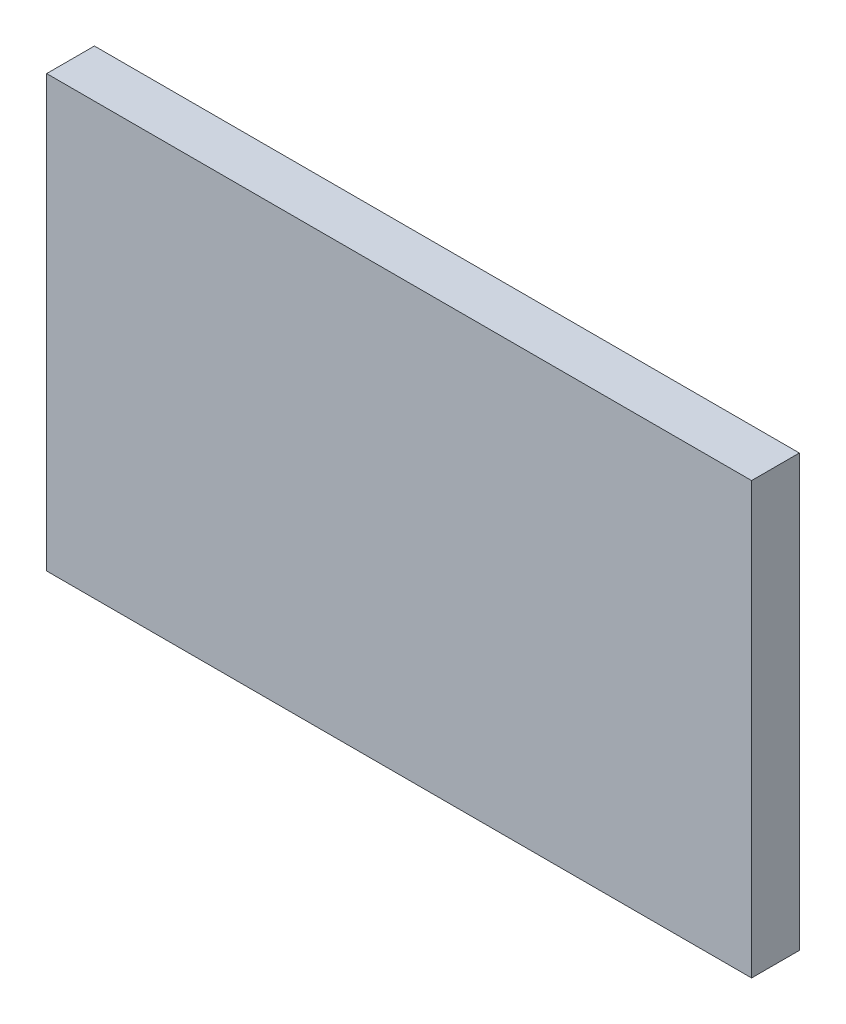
ISO-10303-21;
HEADER;
FILE_DESCRIPTION(('STEP AP214'),'2;1');
FILE_NAME('part.step','',(''),(''),'','','');
FILE_SCHEMA(('AUTOMOTIVE_DESIGN { 1 0 10303 214 1 1 1 1 }'));
ENDSEC;
DATA;
#1=APPLICATION_CONTEXT('core data for automotive mechanical design processes');
#2=APPLICATION_PROTOCOL_DEFINITION('international standard','automotive_design',2000,#1);
#3=PRODUCT_CONTEXT('',#1,'mechanical');
#4=PRODUCT('Part','Part','',(#3));
#5=PRODUCT_RELATED_PRODUCT_CATEGORY('part','',(#4));
#6=PRODUCT_DEFINITION_FORMATION('','',#4);
#7=PRODUCT_DEFINITION_CONTEXT('part definition',#1,'design');
#8=PRODUCT_DEFINITION('design','',#6,#7);
#9=PRODUCT_DEFINITION_SHAPE('','',#8);
#10=(LENGTH_UNIT() NAMED_UNIT(*) SI_UNIT(.MILLI.,.METRE.));
#11=(NAMED_UNIT(*) PLANE_ANGLE_UNIT() SI_UNIT($,.RADIAN.));
#12=(NAMED_UNIT(*) SI_UNIT($,.STERADIAN.) SOLID_ANGLE_UNIT());
#13=UNCERTAINTY_MEASURE_WITH_UNIT(LENGTH_MEASURE(1.E-05),#10,'distance_accuracy_value','');
#14=(GEOMETRIC_REPRESENTATION_CONTEXT(3) GLOBAL_UNCERTAINTY_ASSIGNED_CONTEXT((#13)) GLOBAL_UNIT_ASSIGNED_CONTEXT((#10,
#11,#12)) REPRESENTATION_CONTEXT('',''));
#15=CARTESIAN_POINT('',(0.,0.,0.));
#16=DIRECTION('',(0.,0.,1.));
#17=DIRECTION('',(1.,0.,0.));
#18=AXIS2_PLACEMENT_3D('',#15,#16,#17);
#19=CARTESIAN_POINT('',(8.675,23.1,-0.03048));
#20=DIRECTION('',(0.,-1.,0.));
#21=DIRECTION('',(0.,0.,-1.));
#22=AXIS2_PLACEMENT_3D('',#19,#20,#21);
#23=PLANE('',#22);
#24=DIRECTION('',(1.,0.,0.));
#25=VECTOR('',#24,1.);
#26=CARTESIAN_POINT('',(8.9,23.1,0.));
#27=LINE('',#26,#25);
#28=CARTESIAN_POINT('',(8.675,23.1,0.));
#29=VERTEX_POINT('',#28);
#30=CARTESIAN_POINT('',(9.125,23.1,0.));
#31=VERTEX_POINT('',#30);
#32=EDGE_CURVE('E75',#29,#31,#27,.T.);
#33=ORIENTED_EDGE('',*,*,#32,.T.);
#34=DIRECTION('',(0.,0.,-1.));
#35=VECTOR('',#34,1.);
#36=CARTESIAN_POINT('',(9.125,23.1,-0.01524));
#37=LINE('',#36,#35);
#38=CARTESIAN_POINT('',(9.125,23.1,-0.03048));
#39=VERTEX_POINT('',#38);
#40=EDGE_CURVE('E20',#31,#39,#37,.T.);
#41=ORIENTED_EDGE('',*,*,#40,.T.);
#42=DIRECTION('',(1.,0.,0.));
#43=VECTOR('',#42,1.);
#44=CARTESIAN_POINT('',(8.675,23.1,-0.03048));
#45=LINE('',#44,#43);
#46=CARTESIAN_POINT('',(8.675,23.1,-0.03048));
#47=VERTEX_POINT('',#46);
#48=EDGE_CURVE('E77',#47,#39,#45,.T.);
#49=ORIENTED_EDGE('',*,*,#48,.F.);
#50=DIRECTION('',(0.,0.,-1.));
#51=VECTOR('',#50,1.);
#52=CARTESIAN_POINT('',(8.675,23.1,-0.01524));
#53=LINE('',#52,#51);
#54=EDGE_CURVE('E11',#29,#47,#53,.T.);
#55=ORIENTED_EDGE('',*,*,#54,.F.);
#56=EDGE_LOOP('',(#33,#41,#49,#55));
#57=FACE_BOUND('',#56,.T.);
#58=ADVANCED_FACE('F17',(#57),#23,.F.);
#59=CARTESIAN_POINT('',(8.675,22.825,-0.03048));
#60=DIRECTION('',(1.,0.,0.));
#61=DIRECTION('',(0.,1.,0.));
#62=AXIS2_PLACEMENT_3D('',#59,#60,#61);
#63=PLANE('',#62);
#64=DIRECTION('',(0.,1.,0.));
#65=VECTOR('',#64,1.);
#66=CARTESIAN_POINT('',(8.675,22.9625,0.));
#67=LINE('',#66,#65);
#68=CARTESIAN_POINT('',(8.675,22.825,0.));
#69=VERTEX_POINT('',#68);
#70=EDGE_CURVE('E79',#69,#29,#67,.T.);
#71=ORIENTED_EDGE('',*,*,#70,.T.);
#72=ORIENTED_EDGE('',*,*,#54,.T.);
#73=DIRECTION('',(0.,1.,0.));
#74=VECTOR('',#73,1.);
#75=CARTESIAN_POINT('',(8.675,22.825,-0.03048));
#76=LINE('',#75,#74);
#77=CARTESIAN_POINT('',(8.675,22.825,-0.03048));
#78=VERTEX_POINT('',#77);
#79=EDGE_CURVE('E103',#78,#47,#76,.T.);
#80=ORIENTED_EDGE('',*,*,#79,.F.);
#81=DIRECTION('',(0.,0.,-1.));
#82=VECTOR('',#81,1.);
#83=CARTESIAN_POINT('',(8.675,22.825,-0.01524));
#84=LINE('',#83,#82);
#85=EDGE_CURVE('E27',#69,#78,#84,.T.);
#86=ORIENTED_EDGE('',*,*,#85,.F.);
#87=EDGE_LOOP('',(#71,#72,#80,#86));
#88=FACE_BOUND('',#87,.T.);
#89=ADVANCED_FACE('F80',(#88),#63,.F.);
#90=CARTESIAN_POINT('',(9.125,22.825,-0.03048));
#91=DIRECTION('',(0.,1.,0.));
#92=DIRECTION('',(1.,0.,0.));
#93=AXIS2_PLACEMENT_3D('',#90,#91,#92);
#94=PLANE('',#93);
#95=DIRECTION('',(-1.,0.,0.));
#96=VECTOR('',#95,1.);
#97=CARTESIAN_POINT('',(8.9,22.825,0.));
#98=LINE('',#97,#96);
#99=CARTESIAN_POINT('',(9.125,22.825,0.));
#100=VERTEX_POINT('',#99);
#101=EDGE_CURVE('E84',#100,#69,#98,.T.);
#102=ORIENTED_EDGE('',*,*,#101,.T.);
#103=ORIENTED_EDGE('',*,*,#85,.T.);
#104=DIRECTION('',(-1.,0.,0.));
#105=VECTOR('',#104,1.);
#106=CARTESIAN_POINT('',(9.125,22.825,-0.03048));
#107=LINE('',#106,#105);
#108=CARTESIAN_POINT('',(9.125,22.825,-0.03048));
#109=VERTEX_POINT('',#108);
#110=EDGE_CURVE('E99',#109,#78,#107,.T.);
#111=ORIENTED_EDGE('',*,*,#110,.F.);
#112=DIRECTION('',(0.,0.,-1.));
#113=VECTOR('',#112,1.);
#114=CARTESIAN_POINT('',(9.125,22.825,-0.01524));
#115=LINE('',#114,#113);
#116=EDGE_CURVE('E60',#100,#109,#115,.T.);
#117=ORIENTED_EDGE('',*,*,#116,.F.);
#118=EDGE_LOOP('',(#102,#103,#111,#117));
#119=FACE_BOUND('',#118,.T.);
#120=ADVANCED_FACE('F121',(#119),#94,.F.);
#121=CARTESIAN_POINT('',(9.125,23.1,-0.03048));
#122=DIRECTION('',(-1.,0.,0.));
#123=DIRECTION('',(0.,0.,1.));
#124=AXIS2_PLACEMENT_3D('',#121,#122,#123);
#125=PLANE('',#124);
#126=DIRECTION('',(0.,-1.,0.));
#127=VECTOR('',#126,1.);
#128=CARTESIAN_POINT('',(9.125,22.9625,0.));
#129=LINE('',#128,#127);
#130=EDGE_CURVE('E88',#31,#100,#129,.T.);
#131=ORIENTED_EDGE('',*,*,#130,.T.);
#132=ORIENTED_EDGE('',*,*,#116,.T.);
#133=DIRECTION('',(0.,-1.,0.));
#134=VECTOR('',#133,1.);
#135=CARTESIAN_POINT('',(9.125,23.1,-0.03048));
#136=LINE('',#135,#134);
#137=EDGE_CURVE('E104',#39,#109,#136,.T.);
#138=ORIENTED_EDGE('',*,*,#137,.F.);
#139=ORIENTED_EDGE('',*,*,#40,.F.);
#140=EDGE_LOOP('',(#131,#132,#138,#139));
#141=FACE_BOUND('',#140,.T.);
#142=ADVANCED_FACE('F118',(#141),#125,.F.);
#143=CARTESIAN_POINT('',(8.9,22.9625,-0.03048));
#144=DIRECTION('',(0.,0.,1.));
#145=DIRECTION('',(1.,0.,0.));
#146=AXIS2_PLACEMENT_3D('',#143,#144,#145);
#147=PLANE('',#146);
#148=ORIENTED_EDGE('',*,*,#48,.T.);
#149=ORIENTED_EDGE('',*,*,#137,.T.);
#150=ORIENTED_EDGE('',*,*,#110,.T.);
#151=ORIENTED_EDGE('',*,*,#79,.T.);
#152=EDGE_LOOP('',(#148,#149,#150,#151));
#153=FACE_BOUND('',#152,.T.);
#154=ADVANCED_FACE('F120',(#153),#147,.F.);
#155=CARTESIAN_POINT('',(8.9,22.9625,0.));
#156=DIRECTION('',(0.,0.,1.));
#157=DIRECTION('',(1.,0.,0.));
#158=AXIS2_PLACEMENT_3D('',#155,#156,#157);
#159=PLANE('',#158);
#160=ORIENTED_EDGE('',*,*,#32,.F.);
#161=ORIENTED_EDGE('',*,*,#70,.F.);
#162=ORIENTED_EDGE('',*,*,#101,.F.);
#163=ORIENTED_EDGE('',*,*,#130,.F.);
#164=EDGE_LOOP('',(#160,#161,#162,#163));
#165=FACE_BOUND('',#164,.T.);
#166=ADVANCED_FACE('F87',(#165),#159,.T.);
#167=CLOSED_SHELL('',(#58,#89,#120,#142,#154,#166));
#168=MANIFOLD_SOLID_BREP('B1',#167);
#169=ADVANCED_BREP_SHAPE_REPRESENTATION('',(#18,#168),#14);
#170=SHAPE_DEFINITION_REPRESENTATION(#9,#169);
ENDSEC;
END-ISO-10303-21;
